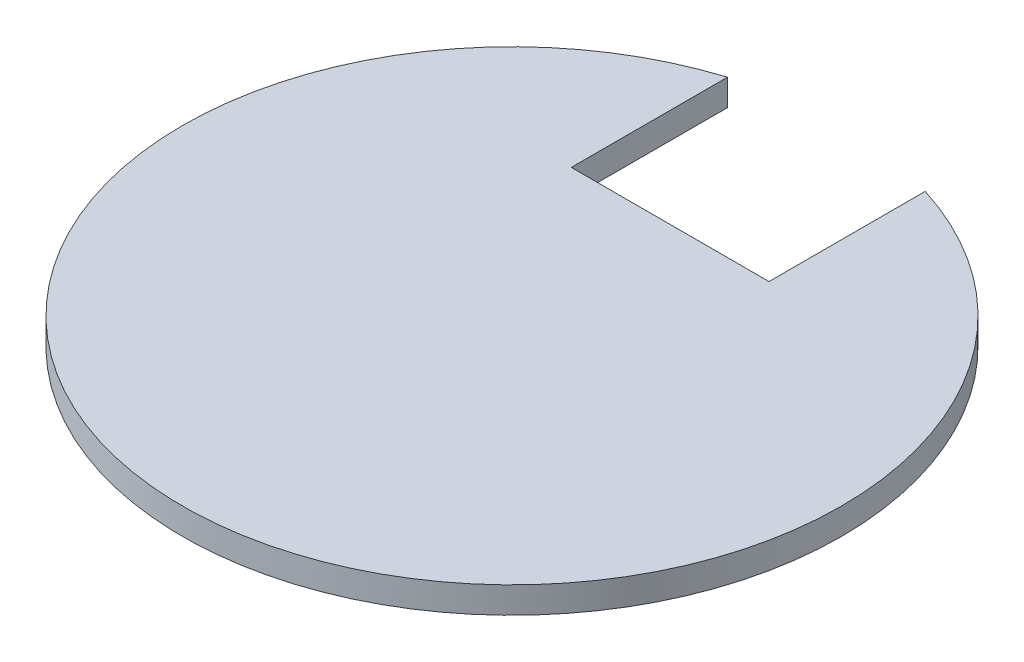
ISO-10303-21;
HEADER;
FILE_DESCRIPTION(('STEP AP214'),'2;1');
FILE_NAME('part.step','',(''),(''),'','','');
FILE_SCHEMA(('AUTOMOTIVE_DESIGN { 1 0 10303 214 1 1 1 1 }'));
ENDSEC;
DATA;
#1=APPLICATION_CONTEXT('core data for automotive mechanical design processes');
#2=APPLICATION_PROTOCOL_DEFINITION('international standard','automotive_design',2000,#1);
#3=PRODUCT_CONTEXT('',#1,'mechanical');
#4=PRODUCT('Part','Part','',(#3));
#5=PRODUCT_RELATED_PRODUCT_CATEGORY('part','',(#4));
#6=PRODUCT_DEFINITION_FORMATION('','',#4);
#7=PRODUCT_DEFINITION_CONTEXT('part definition',#1,'design');
#8=PRODUCT_DEFINITION('design','',#6,#7);
#9=PRODUCT_DEFINITION_SHAPE('','',#8);
#10=(LENGTH_UNIT() NAMED_UNIT(*) SI_UNIT(.MILLI.,.METRE.));
#11=(NAMED_UNIT(*) PLANE_ANGLE_UNIT() SI_UNIT($,.RADIAN.));
#12=(NAMED_UNIT(*) SI_UNIT($,.STERADIAN.) SOLID_ANGLE_UNIT());
#13=UNCERTAINTY_MEASURE_WITH_UNIT(LENGTH_MEASURE(1.E-05),#10,'distance_accuracy_value','');
#14=(GEOMETRIC_REPRESENTATION_CONTEXT(3) GLOBAL_UNCERTAINTY_ASSIGNED_CONTEXT((#13)) GLOBAL_UNIT_ASSIGNED_CONTEXT((#10,
#11,#12)) REPRESENTATION_CONTEXT('',''));
#15=CARTESIAN_POINT('',(0.,0.,0.));
#16=DIRECTION('',(0.,0.,1.));
#17=DIRECTION('',(1.,0.,0.));
#18=AXIS2_PLACEMENT_3D('',#15,#16,#17);
#19=CARTESIAN_POINT('',(0.,2.,0.));
#20=DIRECTION('',(0.,-1.,0.));
#21=DIRECTION('',(0.,0.,-1.));
#22=AXIS2_PLACEMENT_3D('',#19,#20,#21);
#23=CYLINDRICAL_SURFACE('',#22,25.);
#24=DIRECTION('',(0.,-1.,0.));
#25=VECTOR('',#24,1.);
#26=CARTESIAN_POINT('',(7.5,2.,-23.8484800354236));
#27=LINE('',#26,#25);
#28=CARTESIAN_POINT('',(7.5,2.,-23.8484800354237));
#29=VERTEX_POINT('',#28);
#30=CARTESIAN_POINT('',(7.5,0.,-23.8484800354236));
#31=VERTEX_POINT('',#30);
#32=EDGE_CURVE('E54',#29,#31,#27,.T.);
#33=ORIENTED_EDGE('',*,*,#32,.F.);
#34=CARTESIAN_POINT('',(0.,2.,0.));
#35=DIRECTION('',(0.,-1.,0.));
#36=DIRECTION('',(0.,0.,-1.));
#37=AXIS2_PLACEMENT_3D('',#34,#35,#36);
#38=CIRCLE('',#37,25.);
#39=CARTESIAN_POINT('',(-7.5,2.,-23.8484800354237));
#40=VERTEX_POINT('',#39);
#41=EDGE_CURVE('E88',#29,#40,#38,.T.);
#42=ORIENTED_EDGE('',*,*,#41,.T.);
#43=DIRECTION('',(0.,-1.,0.));
#44=VECTOR('',#43,1.);
#45=CARTESIAN_POINT('',(-7.5,2.,-23.8484800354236));
#46=LINE('',#45,#44);
#47=CARTESIAN_POINT('',(-7.5,0.,-23.8484800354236));
#48=VERTEX_POINT('',#47);
#49=EDGE_CURVE('E92',#48,#40,#46,.F.);
#50=ORIENTED_EDGE('',*,*,#49,.F.);
#51=CARTESIAN_POINT('',(0.,0.,0.));
#52=DIRECTION('',(0.,-1.,0.));
#53=DIRECTION('',(0.,0.,-1.));
#54=AXIS2_PLACEMENT_3D('',#51,#52,#53);
#55=CIRCLE('',#54,25.);
#56=EDGE_CURVE('E96',#31,#48,#55,.T.);
#57=ORIENTED_EDGE('',*,*,#56,.F.);
#58=EDGE_LOOP('',(#33,#42,#50,#57));
#59=FACE_BOUND('',#58,.T.);
#60=ADVANCED_FACE('F34',(#59),#23,.T.);
#61=CARTESIAN_POINT('',(0.,2.,0.));
#62=DIRECTION('',(0.,-1.,0.));
#63=DIRECTION('',(0.,0.,-1.));
#64=AXIS2_PLACEMENT_3D('',#61,#62,#63);
#65=PLANE('',#64);
#66=ORIENTED_EDGE('',*,*,#41,.F.);
#67=DIRECTION('',(0.,0.,1.));
#68=VECTOR('',#67,1.);
#69=CARTESIAN_POINT('',(7.5,2.,-42.));
#70=LINE('',#69,#68);
#71=CARTESIAN_POINT('',(7.5,2.,-12.));
#72=VERTEX_POINT('',#71);
#73=EDGE_CURVE('E72',#29,#72,#70,.T.);
#74=ORIENTED_EDGE('',*,*,#73,.T.);
#75=DIRECTION('',(-1.,0.,0.));
#76=VECTOR('',#75,1.);
#77=CARTESIAN_POINT('',(-7.5,2.,-12.));
#78=LINE('',#77,#76);
#79=CARTESIAN_POINT('',(-7.5,2.,-12.));
#80=VERTEX_POINT('',#79);
#81=EDGE_CURVE('E78',#72,#80,#78,.T.);
#82=ORIENTED_EDGE('',*,*,#81,.T.);
#83=DIRECTION('',(0.,0.,-1.));
#84=VECTOR('',#83,1.);
#85=CARTESIAN_POINT('',(-7.5,2.,-42.));
#86=LINE('',#85,#84);
#87=EDGE_CURVE('E75',#80,#40,#86,.T.);
#88=ORIENTED_EDGE('',*,*,#87,.T.);
#89=EDGE_LOOP('',(#66,#74,#82,#88));
#90=FACE_BOUND('',#89,.T.);
#91=ADVANCED_FACE('F86',(#90),#65,.F.);
#92=CARTESIAN_POINT('',(0.,0.,0.));
#93=DIRECTION('',(0.,-1.,0.));
#94=DIRECTION('',(0.,0.,-1.));
#95=AXIS2_PLACEMENT_3D('',#92,#93,#94);
#96=PLANE('',#95);
#97=DIRECTION('',(0.,0.,1.));
#98=VECTOR('',#97,1.);
#99=CARTESIAN_POINT('',(7.5,0.,0.));
#100=LINE('',#99,#98);
#101=CARTESIAN_POINT('',(7.5,0.,-12.));
#102=VERTEX_POINT('',#101);
#103=EDGE_CURVE('E11',#31,#102,#100,.T.);
#104=ORIENTED_EDGE('',*,*,#103,.F.);
#105=ORIENTED_EDGE('',*,*,#56,.T.);
#106=DIRECTION('',(0.,0.,-1.));
#107=VECTOR('',#106,1.);
#108=CARTESIAN_POINT('',(-7.5,0.,0.));
#109=LINE('',#108,#107);
#110=CARTESIAN_POINT('',(-7.5,0.,-12.));
#111=VERTEX_POINT('',#110);
#112=EDGE_CURVE('E41',#111,#48,#109,.T.);
#113=ORIENTED_EDGE('',*,*,#112,.F.);
#114=DIRECTION('',(-1.,0.,0.));
#115=VECTOR('',#114,1.);
#116=CARTESIAN_POINT('',(0.,0.,-12.));
#117=LINE('',#116,#115);
#118=EDGE_CURVE('E98',#102,#111,#117,.T.);
#119=ORIENTED_EDGE('',*,*,#118,.F.);
#120=EDGE_LOOP('',(#104,#105,#113,#119));
#121=FACE_BOUND('',#120,.T.);
#122=ADVANCED_FACE('F108',(#121),#96,.T.);
#123=CARTESIAN_POINT('',(7.5,2.,-42.));
#124=DIRECTION('',(1.,0.,0.));
#125=DIRECTION('',(0.,0.,-1.));
#126=AXIS2_PLACEMENT_3D('',#123,#124,#125);
#127=PLANE('',#126);
#128=ORIENTED_EDGE('',*,*,#32,.T.);
#129=ORIENTED_EDGE('',*,*,#103,.T.);
#130=DIRECTION('',(0.,-1.,0.));
#131=VECTOR('',#130,1.);
#132=CARTESIAN_POINT('',(7.5,2.,-12.));
#133=LINE('',#132,#131);
#134=EDGE_CURVE('E48',#72,#102,#133,.T.);
#135=ORIENTED_EDGE('',*,*,#134,.F.);
#136=ORIENTED_EDGE('',*,*,#73,.F.);
#137=EDGE_LOOP('',(#128,#129,#135,#136));
#138=FACE_BOUND('',#137,.T.);
#139=ADVANCED_FACE('F70',(#138),#127,.F.);
#140=CARTESIAN_POINT('',(-7.5,2.,-42.));
#141=DIRECTION('',(-1.,0.,0.));
#142=DIRECTION('',(0.,0.,1.));
#143=AXIS2_PLACEMENT_3D('',#140,#141,#142);
#144=PLANE('',#143);
#145=ORIENTED_EDGE('',*,*,#49,.T.);
#146=ORIENTED_EDGE('',*,*,#87,.F.);
#147=DIRECTION('',(0.,-1.,0.));
#148=VECTOR('',#147,1.);
#149=CARTESIAN_POINT('',(-7.5,2.,-12.));
#150=LINE('',#149,#148);
#151=EDGE_CURVE('E74',#80,#111,#150,.T.);
#152=ORIENTED_EDGE('',*,*,#151,.T.);
#153=ORIENTED_EDGE('',*,*,#112,.T.);
#154=EDGE_LOOP('',(#145,#146,#152,#153));
#155=FACE_BOUND('',#154,.T.);
#156=ADVANCED_FACE('F104',(#155),#144,.F.);
#157=CARTESIAN_POINT('',(-7.5,2.,-12.));
#158=DIRECTION('',(0.,0.,1.));
#159=DIRECTION('',(1.,0.,0.));
#160=AXIS2_PLACEMENT_3D('',#157,#158,#159);
#161=PLANE('',#160);
#162=ORIENTED_EDGE('',*,*,#118,.T.);
#163=ORIENTED_EDGE('',*,*,#151,.F.);
#164=ORIENTED_EDGE('',*,*,#81,.F.);
#165=ORIENTED_EDGE('',*,*,#134,.T.);
#166=EDGE_LOOP('',(#162,#163,#164,#165));
#167=FACE_BOUND('',#166,.T.);
#168=ADVANCED_FACE('F79',(#167),#161,.F.);
#169=CLOSED_SHELL('',(#60,#91,#122,#139,#156,#168));
#170=MANIFOLD_SOLID_BREP('B2',#169);
#171=ADVANCED_BREP_SHAPE_REPRESENTATION('',(#18,#170),#14);
#172=SHAPE_DEFINITION_REPRESENTATION(#9,#171);
ENDSEC;
END-ISO-10303-21;
